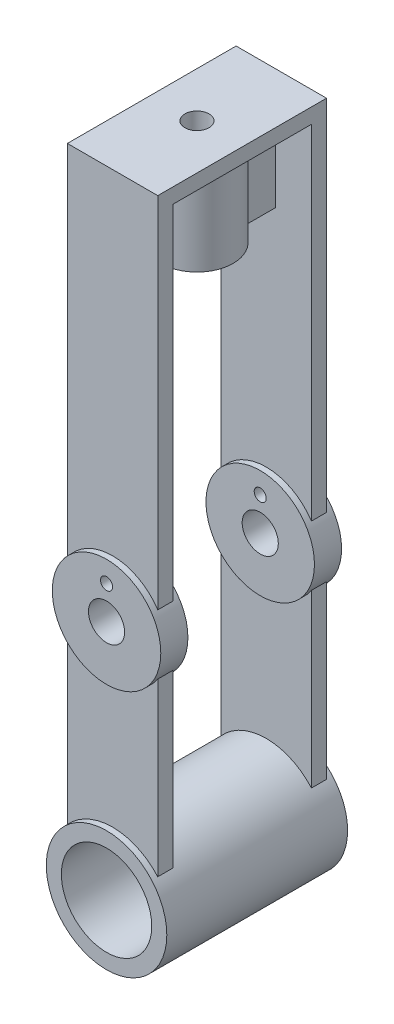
ISO-10303-21;
HEADER;
FILE_DESCRIPTION(('STEP AP214'),'2;1');
FILE_NAME('part.step','',(''),(''),'','','');
FILE_SCHEMA(('AUTOMOTIVE_DESIGN { 1 0 10303 214 1 1 1 1 }'));
ENDSEC;
DATA;
#1=APPLICATION_CONTEXT('core data for automotive mechanical design processes');
#2=APPLICATION_PROTOCOL_DEFINITION('international standard','automotive_design',2000,#1);
#3=PRODUCT_CONTEXT('',#1,'mechanical');
#4=PRODUCT('Part','Part','',(#3));
#5=PRODUCT_RELATED_PRODUCT_CATEGORY('part','',(#4));
#6=PRODUCT_DEFINITION_FORMATION('','',#4);
#7=PRODUCT_DEFINITION_CONTEXT('part definition',#1,'design');
#8=PRODUCT_DEFINITION('design','',#6,#7);
#9=PRODUCT_DEFINITION_SHAPE('','',#8);
#10=(LENGTH_UNIT() NAMED_UNIT(*) SI_UNIT(.MILLI.,.METRE.));
#11=(NAMED_UNIT(*) PLANE_ANGLE_UNIT() SI_UNIT($,.RADIAN.));
#12=(NAMED_UNIT(*) SI_UNIT($,.STERADIAN.) SOLID_ANGLE_UNIT());
#13=UNCERTAINTY_MEASURE_WITH_UNIT(LENGTH_MEASURE(1.E-05),#10,'distance_accuracy_value','');
#14=(GEOMETRIC_REPRESENTATION_CONTEXT(3) GLOBAL_UNCERTAINTY_ASSIGNED_CONTEXT((#13)) GLOBAL_UNIT_ASSIGNED_CONTEXT((#10,
#11,#12)) REPRESENTATION_CONTEXT('',''));
#15=CARTESIAN_POINT('',(0.,0.,0.));
#16=DIRECTION('',(0.,0.,1.));
#17=DIRECTION('',(1.,0.,0.));
#18=AXIS2_PLACEMENT_3D('',#15,#16,#17);
#19=CARTESIAN_POINT('',(125.5,78.5,-32.));
#20=DIRECTION('',(0.,-1.,0.));
#21=DIRECTION('',(0.,0.,1.));
#22=AXIS2_PLACEMENT_3D('',#19,#20,#21);
#23=PLANE('',#22);
#24=CARTESIAN_POINT('',(121.5,78.5,-28.));
#25=DIRECTION('',(0.,1.,0.));
#26=DIRECTION('',(-1.,0.,0.));
#27=AXIS2_PLACEMENT_3D('',#24,#25,#26);
#28=CIRCLE('',#27,4.);
#29=CARTESIAN_POINT('',(117.5,78.5,-28.));
#30=VERTEX_POINT('',#29);
#31=EDGE_CURVE('E326',#30,#30,#28,.F.);
#32=ORIENTED_EDGE('',*,*,#31,.F.);
#33=EDGE_LOOP('',(#32));
#34=FACE_BOUND('',#33,.T.);
#35=ADVANCED_FACE('F15',(#34),#23,.F.);
#36=CARTESIAN_POINT('',(121.5,-20.5,-58.));
#37=DIRECTION('',(0.,0.,1.));
#38=DIRECTION('',(1.,0.,0.));
#39=AXIS2_PLACEMENT_3D('',#36,#37,#38);
#40=CYLINDRICAL_SURFACE('',#39,5.99999999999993);
#41=CARTESIAN_POINT('',(121.5,-20.5,-49.));
#42=DIRECTION('',(0.,0.,1.));
#43=DIRECTION('',(1.,0.,0.));
#44=AXIS2_PLACEMENT_3D('',#41,#42,#43);
#45=CIRCLE('',#44,5.99999999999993);
#46=CARTESIAN_POINT('',(127.5,-20.5,-49.));
#47=VERTEX_POINT('',#46);
#48=EDGE_CURVE('E321',#47,#47,#45,.T.);
#49=ORIENTED_EDGE('',*,*,#48,.T.);
#50=EDGE_LOOP('',(#49));
#51=FACE_BOUND('',#50,.T.);
#52=CARTESIAN_POINT('',(121.5,-20.5,-58.));
#53=DIRECTION('',(0.,0.,1.));
#54=DIRECTION('',(1.,0.,0.));
#55=AXIS2_PLACEMENT_3D('',#52,#53,#54);
#56=CIRCLE('',#55,5.99999999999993);
#57=CARTESIAN_POINT('',(127.5,-20.5,-58.));
#58=VERTEX_POINT('',#57);
#59=EDGE_CURVE('E311',#58,#58,#56,.T.);
#60=ORIENTED_EDGE('',*,*,#59,.F.);
#61=EDGE_LOOP('',(#60));
#62=FACE_BOUND('',#61,.T.);
#63=ADVANCED_FACE('F913',(#51,#62),#40,.F.);
#64=CARTESIAN_POINT('',(121.5,-9.5,-58.));
#65=DIRECTION('',(0.,0.,1.));
#66=DIRECTION('',(1.,0.,0.));
#67=AXIS2_PLACEMENT_3D('',#64,#65,#66);
#68=CYLINDRICAL_SURFACE('',#67,1.99999999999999);
#69=CARTESIAN_POINT('',(121.5,-9.5,-49.));
#70=DIRECTION('',(0.,0.,1.));
#71=DIRECTION('',(1.,0.,0.));
#72=AXIS2_PLACEMENT_3D('',#69,#70,#71);
#73=CIRCLE('',#72,1.99999999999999);
#74=CARTESIAN_POINT('',(123.5,-9.5,-49.));
#75=VERTEX_POINT('',#74);
#76=EDGE_CURVE('E316',#75,#75,#73,.T.);
#77=ORIENTED_EDGE('',*,*,#76,.T.);
#78=EDGE_LOOP('',(#77));
#79=FACE_BOUND('',#78,.T.);
#80=CARTESIAN_POINT('',(121.5,-9.5,-58.));
#81=DIRECTION('',(0.,0.,1.));
#82=DIRECTION('',(1.,0.,0.));
#83=AXIS2_PLACEMENT_3D('',#80,#81,#82);
#84=CIRCLE('',#83,1.99999999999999);
#85=CARTESIAN_POINT('',(123.5,-9.5,-58.));
#86=VERTEX_POINT('',#85);
#87=EDGE_CURVE('E308',#86,#86,#84,.T.);
#88=ORIENTED_EDGE('',*,*,#87,.F.);
#89=EDGE_LOOP('',(#88));
#90=FACE_BOUND('',#89,.T.);
#91=ADVANCED_FACE('F906',(#79,#90),#68,.F.);
#92=CARTESIAN_POINT('',(121.5,103.5,-28.));
#93=DIRECTION('',(0.,-1.,0.));
#94=DIRECTION('',(0.,0.,-1.));
#95=AXIS2_PLACEMENT_3D('',#92,#93,#94);
#96=CYLINDRICAL_SURFACE('',#95,12.);
#97=DIRECTION('',(0.,-1.,0.));
#98=VECTOR('',#97,1.);
#99=CARTESIAN_POINT('',(124.5,88.5,-39.6189500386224));
#100=LINE('',#99,#98);
#101=CARTESIAN_POINT('',(124.5,103.5,-39.6189500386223));
#102=VERTEX_POINT('',#101);
#103=CARTESIAN_POINT('',(124.5,73.5,-39.6189500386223));
#104=VERTEX_POINT('',#103);
#105=EDGE_CURVE('E137',#102,#104,#100,.T.);
#106=ORIENTED_EDGE('',*,*,#105,.F.);
#107=CARTESIAN_POINT('',(121.5,103.5,-28.));
#108=DIRECTION('',(0.,-1.,0.));
#109=DIRECTION('',(0.,0.,-1.));
#110=AXIS2_PLACEMENT_3D('',#107,#108,#109);
#111=CIRCLE('',#110,12.);
#112=CARTESIAN_POINT('',(124.5,103.5,-16.3810499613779));
#113=VERTEX_POINT('',#112);
#114=EDGE_CURVE('E140',#102,#113,#111,.T.);
#115=ORIENTED_EDGE('',*,*,#114,.T.);
#116=DIRECTION('',(0.,1.,0.));
#117=VECTOR('',#116,1.);
#118=CARTESIAN_POINT('',(124.5,88.5,-16.381049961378));
#119=LINE('',#118,#117);
#120=CARTESIAN_POINT('',(124.5,73.5,-16.3810499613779));
#121=VERTEX_POINT('',#120);
#122=EDGE_CURVE('E144',#121,#113,#119,.T.);
#123=ORIENTED_EDGE('',*,*,#122,.F.);
#124=CARTESIAN_POINT('',(121.5,73.5,-28.));
#125=DIRECTION('',(0.,-1.,0.));
#126=DIRECTION('',(0.,0.,-1.));
#127=AXIS2_PLACEMENT_3D('',#124,#125,#126);
#128=CIRCLE('',#127,12.);
#129=EDGE_CURVE('E161',#104,#121,#128,.T.);
#130=ORIENTED_EDGE('',*,*,#129,.F.);
#131=EDGE_LOOP('',(#106,#115,#123,#130));
#132=FACE_BOUND('',#131,.T.);
#133=ADVANCED_FACE('F142',(#132),#96,.T.);
#134=CARTESIAN_POINT('',(124.5,73.5,-51.));
#135=DIRECTION('',(1.,0.,0.));
#136=DIRECTION('',(0.,1.,0.));
#137=AXIS2_PLACEMENT_3D('',#134,#135,#136);
#138=PLANE('',#137);
#139=DIRECTION('',(0.,0.,1.));
#140=VECTOR('',#139,1.);
#141=CARTESIAN_POINT('',(124.5,103.5,-28.));
#142=LINE('',#141,#140);
#143=CARTESIAN_POINT('',(124.5,103.5,-51.));
#144=VERTEX_POINT('',#143);
#145=EDGE_CURVE('E148',#144,#102,#142,.T.);
#146=ORIENTED_EDGE('',*,*,#145,.T.);
#147=ORIENTED_EDGE('',*,*,#105,.T.);
#148=DIRECTION('',(0.,0.,1.));
#149=VECTOR('',#148,1.);
#150=CARTESIAN_POINT('',(124.5,73.5,-28.));
#151=LINE('',#150,#149);
#152=CARTESIAN_POINT('',(124.5,73.5000000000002,-51.));
#153=VERTEX_POINT('',#152);
#154=EDGE_CURVE('E399',#153,#104,#151,.T.);
#155=ORIENTED_EDGE('',*,*,#154,.F.);
#156=DIRECTION('',(0.,1.,0.));
#157=VECTOR('',#156,1.);
#158=CARTESIAN_POINT('',(124.5,8.11437827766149,-51.));
#159=LINE('',#158,#157);
#160=EDGE_CURVE('E347',#153,#144,#159,.T.);
#161=ORIENTED_EDGE('',*,*,#160,.T.);
#162=EDGE_LOOP('',(#146,#147,#155,#161));
#163=FACE_BOUND('',#162,.T.);
#164=ADVANCED_FACE('F525',(#163),#138,.T.);
#165=CARTESIAN_POINT('',(121.5,103.5,-28.));
#166=DIRECTION('',(0.,-1.,0.));
#167=DIRECTION('',(0.,0.,-1.));
#168=AXIS2_PLACEMENT_3D('',#165,#166,#167);
#169=CYLINDRICAL_SURFACE('',#168,12.);
#170=CARTESIAN_POINT('',(121.5,73.5,-28.));
#171=DIRECTION('',(0.,-1.,0.));
#172=DIRECTION('',(0.,0.,-1.));
#173=AXIS2_PLACEMENT_3D('',#170,#171,#172);
#174=CIRCLE('',#173,12.);
#175=CARTESIAN_POINT('',(118.5,73.5,-16.3810499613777));
#176=VERTEX_POINT('',#175);
#177=CARTESIAN_POINT('',(118.5,73.5,-39.6189500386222));
#178=VERTEX_POINT('',#177);
#179=EDGE_CURVE('E303',#176,#178,#174,.T.);
#180=ORIENTED_EDGE('',*,*,#179,.F.);
#181=DIRECTION('',(0.,-1.,0.));
#182=VECTOR('',#181,1.);
#183=CARTESIAN_POINT('',(118.5,88.5,-16.3810499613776));
#184=LINE('',#183,#182);
#185=CARTESIAN_POINT('',(118.5,103.5,-16.3810499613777));
#186=VERTEX_POINT('',#185);
#187=EDGE_CURVE('E342',#186,#176,#184,.T.);
#188=ORIENTED_EDGE('',*,*,#187,.F.);
#189=CARTESIAN_POINT('',(121.5,103.5,-28.));
#190=DIRECTION('',(0.,-1.,0.));
#191=DIRECTION('',(0.,0.,-1.));
#192=AXIS2_PLACEMENT_3D('',#189,#190,#191);
#193=CIRCLE('',#192,12.);
#194=CARTESIAN_POINT('',(118.5,103.5,-39.6189500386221));
#195=VERTEX_POINT('',#194);
#196=EDGE_CURVE('E299',#186,#195,#193,.T.);
#197=ORIENTED_EDGE('',*,*,#196,.T.);
#198=DIRECTION('',(0.,1.,0.));
#199=VECTOR('',#198,1.);
#200=CARTESIAN_POINT('',(118.5,88.5,-39.618950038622));
#201=LINE('',#200,#199);
#202=EDGE_CURVE('E329',#178,#195,#201,.T.);
#203=ORIENTED_EDGE('',*,*,#202,.F.);
#204=EDGE_LOOP('',(#180,#188,#197,#203));
#205=FACE_BOUND('',#204,.T.);
#206=ADVANCED_FACE('F573',(#205),#169,.T.);
#207=CARTESIAN_POINT('',(118.5,73.5,-39.618950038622));
#208=DIRECTION('',(-1.,0.,0.));
#209=DIRECTION('',(0.,1.,0.));
#210=AXIS2_PLACEMENT_3D('',#207,#208,#209);
#211=PLANE('',#210);
#212=DIRECTION('',(0.,0.,-1.));
#213=VECTOR('',#212,1.);
#214=CARTESIAN_POINT('',(118.5,103.5,-28.));
#215=LINE('',#214,#213);
#216=CARTESIAN_POINT('',(118.5,103.5,-51.));
#217=VERTEX_POINT('',#216);
#218=EDGE_CURVE('E301',#195,#217,#215,.T.);
#219=ORIENTED_EDGE('',*,*,#218,.T.);
#220=DIRECTION('',(0.,-1.,0.));
#221=VECTOR('',#220,1.);
#222=CARTESIAN_POINT('',(118.5,8.11437827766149,-51.));
#223=LINE('',#222,#221);
#224=CARTESIAN_POINT('',(118.5,73.5000000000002,-51.));
#225=VERTEX_POINT('',#224);
#226=EDGE_CURVE('E345',#217,#225,#223,.T.);
#227=ORIENTED_EDGE('',*,*,#226,.T.);
#228=DIRECTION('',(0.,0.,-1.));
#229=VECTOR('',#228,1.);
#230=CARTESIAN_POINT('',(118.5,73.5,-28.));
#231=LINE('',#230,#229);
#232=EDGE_CURVE('E306',#178,#225,#231,.T.);
#233=ORIENTED_EDGE('',*,*,#232,.F.);
#234=ORIENTED_EDGE('',*,*,#202,.T.);
#235=EDGE_LOOP('',(#219,#227,#233,#234));
#236=FACE_BOUND('',#235,.T.);
#237=ADVANCED_FACE('F881',(#236),#211,.T.);
#238=CARTESIAN_POINT('',(118.5,95.5,-55.5));
#239=DIRECTION('',(1.,0.,0.));
#240=DIRECTION('',(0.,0.,1.));
#241=AXIS2_PLACEMENT_3D('',#238,#239,#240);
#242=PLANE('',#241);
#243=CARTESIAN_POINT('',(118.5,93.5,-53.5));
#244=DIRECTION('',(-1.,0.,0.));
#245=DIRECTION('',(0.,-1.,0.));
#246=AXIS2_PLACEMENT_3D('',#243,#244,#245);
#247=CIRCLE('',#246,2.);
#248=CARTESIAN_POINT('',(118.5,91.5,-53.5));
#249=VERTEX_POINT('',#248);
#250=EDGE_CURVE('E291',#249,#249,#247,.F.);
#251=ORIENTED_EDGE('',*,*,#250,.F.);
#252=EDGE_LOOP('',(#251));
#253=FACE_BOUND('',#252,.T.);
#254=ADVANCED_FACE('F873',(#253),#242,.F.);
#255=CARTESIAN_POINT('',(118.5,95.5,-4.5));
#256=DIRECTION('',(1.,0.,0.));
#257=DIRECTION('',(0.,0.,1.));
#258=AXIS2_PLACEMENT_3D('',#255,#256,#257);
#259=PLANE('',#258);
#260=CARTESIAN_POINT('',(118.5,93.5,-2.5));
#261=DIRECTION('',(-1.,0.,0.));
#262=DIRECTION('',(0.,-1.,0.));
#263=AXIS2_PLACEMENT_3D('',#260,#261,#262);
#264=CIRCLE('',#263,2.);
#265=CARTESIAN_POINT('',(118.5,91.5,-2.5));
#266=VERTEX_POINT('',#265);
#267=EDGE_CURVE('E288',#266,#266,#264,.F.);
#268=ORIENTED_EDGE('',*,*,#267,.F.);
#269=EDGE_LOOP('',(#268));
#270=FACE_BOUND('',#269,.T.);
#271=ADVANCED_FACE('F867',(#270),#259,.F.);
#272=CARTESIAN_POINT('',(121.5,78.5,-28.));
#273=DIRECTION('',(0.,1.,0.));
#274=DIRECTION('',(-1.,0.,0.));
#275=AXIS2_PLACEMENT_3D('',#272,#273,#274);
#276=CYLINDRICAL_SURFACE('',#275,4.);
#277=ORIENTED_EDGE('',*,*,#31,.T.);
#278=EDGE_LOOP('',(#277));
#279=FACE_BOUND('',#278,.T.);
#280=CARTESIAN_POINT('',(121.5,108.5,-28.));
#281=DIRECTION('',(0.,1.,0.));
#282=DIRECTION('',(-1.,0.,0.));
#283=AXIS2_PLACEMENT_3D('',#280,#281,#282);
#284=CIRCLE('',#283,4.);
#285=CARTESIAN_POINT('',(117.5,108.5,-28.));
#286=VERTEX_POINT('',#285);
#287=EDGE_CURVE('E280',#286,#286,#284,.F.);
#288=ORIENTED_EDGE('',*,*,#287,.F.);
#289=EDGE_LOOP('',(#288));
#290=FACE_BOUND('',#289,.T.);
#291=ADVANCED_FACE('F859',(#279,#290),#276,.F.);
#292=CARTESIAN_POINT('',(139.5,-38.5,-49.));
#293=DIRECTION('',(0.,0.,-1.));
#294=DIRECTION('',(-1.,0.,0.));
#295=AXIS2_PLACEMENT_3D('',#292,#293,#294);
#296=PLANE('',#295);
#297=ORIENTED_EDGE('',*,*,#76,.F.);
#298=EDGE_LOOP('',(#297));
#299=FACE_BOUND('',#298,.T.);
#300=ORIENTED_EDGE('',*,*,#48,.F.);
#301=EDGE_LOOP('',(#300));
#302=FACE_BOUND('',#301,.T.);
#303=CARTESIAN_POINT('',(121.5,-20.5,-49.));
#304=DIRECTION('',(0.,0.,1.));
#305=DIRECTION('',(1.,0.,0.));
#306=AXIS2_PLACEMENT_3D('',#303,#304,#305);
#307=CIRCLE('',#306,18.);
#308=CARTESIAN_POINT('',(139.5,-20.5,-49.));
#309=VERTEX_POINT('',#308);
#310=EDGE_CURVE('E275',#309,#309,#307,.T.);
#311=ORIENTED_EDGE('',*,*,#310,.T.);
#312=EDGE_LOOP('',(#311));
#313=FACE_BOUND('',#312,.T.);
#314=ADVANCED_FACE('F851',(#299,#302,#313),#296,.F.);
#315=CARTESIAN_POINT('',(103.5,-2.5,-58.));
#316=DIRECTION('',(0.,0.,-1.));
#317=DIRECTION('',(1.,0.,0.));
#318=AXIS2_PLACEMENT_3D('',#315,#316,#317);
#319=PLANE('',#318);
#320=ORIENTED_EDGE('',*,*,#87,.T.);
#321=EDGE_LOOP('',(#320));
#322=FACE_BOUND('',#321,.T.);
#323=ORIENTED_EDGE('',*,*,#59,.T.);
#324=EDGE_LOOP('',(#323));
#325=FACE_BOUND('',#324,.T.);
#326=CARTESIAN_POINT('',(121.5,-20.5,-58.));
#327=DIRECTION('',(0.,0.,1.));
#328=DIRECTION('',(1.,0.,0.));
#329=AXIS2_PLACEMENT_3D('',#326,#327,#328);
#330=CIRCLE('',#329,18.);
#331=CARTESIAN_POINT('',(139.5,-20.5,-58.));
#332=VERTEX_POINT('',#331);
#333=EDGE_CURVE('E272',#332,#332,#330,.F.);
#334=ORIENTED_EDGE('',*,*,#333,.T.);
#335=EDGE_LOOP('',(#334));
#336=FACE_BOUND('',#335,.T.);
#337=ADVANCED_FACE('F844',(#322,#325,#336),#319,.T.);
#338=CARTESIAN_POINT('',(121.5,-20.5,-7.));
#339=DIRECTION('',(0.,0.,1.));
#340=DIRECTION('',(1.,0.,0.));
#341=AXIS2_PLACEMENT_3D('',#338,#339,#340);
#342=CYLINDRICAL_SURFACE('',#341,5.99999999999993);
#343=CARTESIAN_POINT('',(121.5,-20.5,-7.));
#344=DIRECTION('',(0.,0.,1.));
#345=DIRECTION('',(1.,0.,0.));
#346=AXIS2_PLACEMENT_3D('',#343,#344,#345);
#347=CIRCLE('',#346,5.99999999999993);
#348=CARTESIAN_POINT('',(127.5,-20.5,-7.));
#349=VERTEX_POINT('',#348);
#350=EDGE_CURVE('E261',#349,#349,#347,.F.);
#351=ORIENTED_EDGE('',*,*,#350,.T.);
#352=EDGE_LOOP('',(#351));
#353=FACE_BOUND('',#352,.T.);
#354=CARTESIAN_POINT('',(121.5,-20.5,2.));
#355=DIRECTION('',(0.,0.,1.));
#356=DIRECTION('',(1.,0.,0.));
#357=AXIS2_PLACEMENT_3D('',#354,#355,#356);
#358=CIRCLE('',#357,5.99999999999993);
#359=CARTESIAN_POINT('',(127.5,-20.5,2.));
#360=VERTEX_POINT('',#359);
#361=EDGE_CURVE('E251',#360,#360,#358,.F.);
#362=ORIENTED_EDGE('',*,*,#361,.F.);
#363=EDGE_LOOP('',(#362));
#364=FACE_BOUND('',#363,.T.);
#365=ADVANCED_FACE('F835',(#353,#364),#342,.F.);
#366=CARTESIAN_POINT('',(121.5,-9.5,-7.));
#367=DIRECTION('',(0.,0.,1.));
#368=DIRECTION('',(1.,0.,0.));
#369=AXIS2_PLACEMENT_3D('',#366,#367,#368);
#370=CYLINDRICAL_SURFACE('',#369,1.99999999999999);
#371=CARTESIAN_POINT('',(121.5,-9.5,-7.));
#372=DIRECTION('',(0.,0.,1.));
#373=DIRECTION('',(1.,0.,0.));
#374=AXIS2_PLACEMENT_3D('',#371,#372,#373);
#375=CIRCLE('',#374,1.99999999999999);
#376=CARTESIAN_POINT('',(123.5,-9.5,-7.));
#377=VERTEX_POINT('',#376);
#378=EDGE_CURVE('E256',#377,#377,#375,.F.);
#379=ORIENTED_EDGE('',*,*,#378,.T.);
#380=EDGE_LOOP('',(#379));
#381=FACE_BOUND('',#380,.T.);
#382=CARTESIAN_POINT('',(121.5,-9.5,2.));
#383=DIRECTION('',(0.,0.,1.));
#384=DIRECTION('',(1.,0.,0.));
#385=AXIS2_PLACEMENT_3D('',#382,#383,#384);
#386=CIRCLE('',#385,1.99999999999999);
#387=CARTESIAN_POINT('',(123.5,-9.5,2.));
#388=VERTEX_POINT('',#387);
#389=EDGE_CURVE('E247',#388,#388,#386,.F.);
#390=ORIENTED_EDGE('',*,*,#389,.F.);
#391=EDGE_LOOP('',(#390));
#392=FACE_BOUND('',#391,.T.);
#393=ADVANCED_FACE('F827',(#381,#392),#370,.F.);
#394=CARTESIAN_POINT('',(169.500000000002,103.5,-51.));
#395=DIRECTION('',(0.,1.,0.));
#396=DIRECTION('',(-1.,0.,0.));
#397=AXIS2_PLACEMENT_3D('',#394,#395,#396);
#398=PLANE('',#397);
#399=DIRECTION('',(-1.,0.,0.));
#400=VECTOR('',#399,1.);
#401=CARTESIAN_POINT('',(41.1143782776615,103.5,-5.));
#402=LINE('',#401,#400);
#403=CARTESIAN_POINT('',(136.5,103.5,-5.00000000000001));
#404=VERTEX_POINT('',#403);
#405=CARTESIAN_POINT('',(124.5,103.5,-5.));
#406=VERTEX_POINT('',#405);
#407=EDGE_CURVE('E157',#404,#406,#402,.T.);
#408=ORIENTED_EDGE('',*,*,#407,.T.);
#409=DIRECTION('',(0.,0.,1.));
#410=VECTOR('',#409,1.);
#411=CARTESIAN_POINT('',(124.5,103.5,-1.381049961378));
#412=LINE('',#411,#410);
#413=EDGE_CURVE('E152',#113,#406,#412,.T.);
#414=ORIENTED_EDGE('',*,*,#413,.F.);
#415=ORIENTED_EDGE('',*,*,#114,.F.);
#416=ORIENTED_EDGE('',*,*,#145,.F.);
#417=DIRECTION('',(1.,0.,0.));
#418=VECTOR('',#417,1.);
#419=CARTESIAN_POINT('',(41.1143782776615,103.5,-51.));
#420=LINE('',#419,#418);
#421=CARTESIAN_POINT('',(136.5,103.5,-51.0000000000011));
#422=VERTEX_POINT('',#421);
#423=EDGE_CURVE('E350',#144,#422,#420,.T.);
#424=ORIENTED_EDGE('',*,*,#423,.T.);
#425=DIRECTION('',(0.,0.,-1.));
#426=VECTOR('',#425,1.);
#427=CARTESIAN_POINT('',(136.5,103.5,-97.88562172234));
#428=LINE('',#427,#426);
#429=EDGE_CURVE('E250',#404,#422,#428,.T.);
#430=ORIENTED_EDGE('',*,*,#429,.F.);
#431=EDGE_LOOP('',(#408,#414,#415,#416,#424,#430));
#432=FACE_BOUND('',#431,.T.);
#433=ADVANCED_FACE('F153',(#432),#398,.F.);
#434=CARTESIAN_POINT('',(124.5,73.5,-16.381049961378));
#435=DIRECTION('',(1.,0.,0.));
#436=DIRECTION('',(0.,1.,0.));
#437=AXIS2_PLACEMENT_3D('',#434,#435,#436);
#438=PLANE('',#437);
#439=ORIENTED_EDGE('',*,*,#413,.T.);
#440=DIRECTION('',(0.,-1.,0.));
#441=VECTOR('',#440,1.);
#442=CARTESIAN_POINT('',(124.5,8.1143782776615,-5.));
#443=LINE('',#442,#441);
#444=CARTESIAN_POINT('',(124.5,73.5000000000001,-5.));
#445=VERTEX_POINT('',#444);
#446=EDGE_CURVE('E387',#406,#445,#443,.T.);
#447=ORIENTED_EDGE('',*,*,#446,.T.);
#448=DIRECTION('',(0.,0.,1.));
#449=VECTOR('',#448,1.);
#450=CARTESIAN_POINT('',(124.5,73.5,-28.));
#451=LINE('',#450,#449);
#452=EDGE_CURVE('E165',#121,#445,#451,.T.);
#453=ORIENTED_EDGE('',*,*,#452,.F.);
#454=ORIENTED_EDGE('',*,*,#122,.T.);
#455=EDGE_LOOP('',(#439,#447,#453,#454));
#456=FACE_BOUND('',#455,.T.);
#457=ADVANCED_FACE('F163',(#456),#438,.T.);
#458=CARTESIAN_POINT('',(109.5,73.5,-51.));
#459=DIRECTION('',(0.,-1.,0.));
#460=DIRECTION('',(1.,0.,0.));
#461=AXIS2_PLACEMENT_3D('',#458,#459,#460);
#462=PLANE('',#461);
#463=DIRECTION('',(1.,0.,0.));
#464=VECTOR('',#463,1.);
#465=CARTESIAN_POINT('',(41.1143782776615,73.5000000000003,-51.));
#466=LINE('',#465,#464);
#467=EDGE_CURVE('E351',#225,#153,#466,.T.);
#468=ORIENTED_EDGE('',*,*,#467,.T.);
#469=ORIENTED_EDGE('',*,*,#154,.T.);
#470=ORIENTED_EDGE('',*,*,#129,.T.);
#471=ORIENTED_EDGE('',*,*,#452,.T.);
#472=DIRECTION('',(-1.,0.,0.));
#473=VECTOR('',#472,1.);
#474=CARTESIAN_POINT('',(41.1143782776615,73.5000000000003,-5.));
#475=LINE('',#474,#473);
#476=CARTESIAN_POINT('',(118.5,73.5000000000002,-5.));
#477=VERTEX_POINT('',#476);
#478=EDGE_CURVE('E389',#445,#477,#475,.T.);
#479=ORIENTED_EDGE('',*,*,#478,.T.);
#480=DIRECTION('',(0.,0.,1.));
#481=VECTOR('',#480,1.);
#482=CARTESIAN_POINT('',(118.5,73.5,-20.));
#483=LINE('',#482,#481);
#484=EDGE_CURVE('E346',#176,#477,#483,.T.);
#485=ORIENTED_EDGE('',*,*,#484,.F.);
#486=ORIENTED_EDGE('',*,*,#179,.T.);
#487=ORIENTED_EDGE('',*,*,#232,.T.);
#488=EDGE_LOOP('',(#468,#469,#470,#471,#479,#485,#486,#487));
#489=FACE_BOUND('',#488,.T.);
#490=ADVANCED_FACE('F558',(#489),#462,.T.);
#491=CARTESIAN_POINT('',(118.5,73.5,-5.));
#492=DIRECTION('',(-1.,0.,0.));
#493=DIRECTION('',(0.,1.,0.));
#494=AXIS2_PLACEMENT_3D('',#491,#492,#493);
#495=PLANE('',#494);
#496=DIRECTION('',(0.,0.,-1.));
#497=VECTOR('',#496,1.);
#498=CARTESIAN_POINT('',(118.5,103.5,-28.));
#499=LINE('',#498,#497);
#500=CARTESIAN_POINT('',(118.5,103.5,-5.));
#501=VERTEX_POINT('',#500);
#502=EDGE_CURVE('E302',#501,#186,#499,.T.);
#503=ORIENTED_EDGE('',*,*,#502,.T.);
#504=ORIENTED_EDGE('',*,*,#187,.T.);
#505=ORIENTED_EDGE('',*,*,#484,.T.);
#506=DIRECTION('',(0.,1.,0.));
#507=VECTOR('',#506,1.);
#508=CARTESIAN_POINT('',(118.5,8.11437827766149,-5.));
#509=LINE('',#508,#507);
#510=EDGE_CURVE('E394',#477,#501,#509,.T.);
#511=ORIENTED_EDGE('',*,*,#510,.T.);
#512=EDGE_LOOP('',(#503,#504,#505,#511));
#513=FACE_BOUND('',#512,.T.);
#514=ADVANCED_FACE('F566',(#513),#495,.T.);
#515=CARTESIAN_POINT('',(136.5,-87.271243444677,-56.));
#516=DIRECTION('',(0.,0.,-1.));
#517=DIRECTION('',(-1.,0.,0.));
#518=AXIS2_PLACEMENT_3D('',#515,#516,#517);
#519=PLANE('',#518);
#520=DIRECTION('',(0.,1.,0.));
#521=VECTOR('',#520,1.);
#522=CARTESIAN_POINT('',(136.5,10.6143782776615,-56.0000000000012));
#523=LINE('',#522,#521);
#524=CARTESIAN_POINT('',(136.5,-10.5501256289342,-56.0000000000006));
#525=VERTEX_POINT('',#524);
#526=CARTESIAN_POINT('',(136.5,108.5,-56.0000000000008));
#527=VERTEX_POINT('',#526);
#528=EDGE_CURVE('E377',#525,#527,#523,.T.);
#529=ORIENTED_EDGE('',*,*,#528,.F.);
#530=CARTESIAN_POINT('',(121.5,-20.5,-56.));
#531=DIRECTION('',(0.,0.,1.));
#532=DIRECTION('',(1.,0.,0.));
#533=AXIS2_PLACEMENT_3D('',#530,#531,#532);
#534=CIRCLE('',#533,18.);
#535=CARTESIAN_POINT('',(106.5,-10.5501256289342,-56.0000000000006));
#536=VERTEX_POINT('',#535);
#537=EDGE_CURVE('E270',#525,#536,#534,.T.);
#538=ORIENTED_EDGE('',*,*,#537,.T.);
#539=DIRECTION('',(0.,-1.,0.));
#540=VECTOR('',#539,1.);
#541=CARTESIAN_POINT('',(106.5,10.6143782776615,-56.0000000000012));
#542=LINE('',#541,#540);
#543=CARTESIAN_POINT('',(106.5,108.5,-56.0000000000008));
#544=VERTEX_POINT('',#543);
#545=EDGE_CURVE('E418',#544,#536,#542,.T.);
#546=ORIENTED_EDGE('',*,*,#545,.F.);
#547=DIRECTION('',(-1.,0.,0.));
#548=VECTOR('',#547,1.);
#549=CARTESIAN_POINT('',(108.5,108.5,-56.));
#550=LINE('',#549,#548);
#551=EDGE_CURVE('E285',#527,#544,#550,.T.);
#552=ORIENTED_EDGE('',*,*,#551,.F.);
#553=EDGE_LOOP('',(#529,#538,#546,#552));
#554=FACE_BOUND('',#553,.T.);
#555=ADVANCED_FACE('F585',(#554),#519,.T.);
#556=CARTESIAN_POINT('',(136.5,-87.271243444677,-51.));
#557=DIRECTION('',(0.,0.,-1.));
#558=DIRECTION('',(-1.,0.,0.));
#559=AXIS2_PLACEMENT_3D('',#556,#557,#558);
#560=PLANE('',#559);
#561=ORIENTED_EDGE('',*,*,#423,.F.);
#562=ORIENTED_EDGE('',*,*,#160,.F.);
#563=ORIENTED_EDGE('',*,*,#467,.F.);
#564=ORIENTED_EDGE('',*,*,#226,.F.);
#565=DIRECTION('',(-1.,0.,0.));
#566=VECTOR('',#565,1.);
#567=CARTESIAN_POINT('',(113.5,103.5,-51.));
#568=LINE('',#567,#566);
#569=CARTESIAN_POINT('',(106.5,103.5,-51.0000000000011));
#570=VERTEX_POINT('',#569);
#571=EDGE_CURVE('E296',#217,#570,#568,.T.);
#572=ORIENTED_EDGE('',*,*,#571,.T.);
#573=DIRECTION('',(0.,1.,0.));
#574=VECTOR('',#573,1.);
#575=CARTESIAN_POINT('',(106.5,10.6143782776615,-51.0000000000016));
#576=LINE('',#575,#574);
#577=CARTESIAN_POINT('',(106.5,-10.5501256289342,-51.0000000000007));
#578=VERTEX_POINT('',#577);
#579=EDGE_CURVE('E425',#578,#570,#576,.T.);
#580=ORIENTED_EDGE('',*,*,#579,.F.);
#581=CARTESIAN_POINT('',(121.5,-20.5,-50.9999999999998));
#582=DIRECTION('',(0.,0.,1.));
#583=DIRECTION('',(1.,0.,0.));
#584=AXIS2_PLACEMENT_3D('',#581,#582,#583);
#585=CIRCLE('',#584,18.);
#586=CARTESIAN_POINT('',(136.5,-10.5501256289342,-51.0000000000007));
#587=VERTEX_POINT('',#586);
#588=EDGE_CURVE('E266',#578,#587,#585,.F.);
#589=ORIENTED_EDGE('',*,*,#588,.T.);
#590=DIRECTION('',(0.,-1.,0.));
#591=VECTOR('',#590,1.);
#592=CARTESIAN_POINT('',(136.5,10.6143782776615,-51.0000000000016));
#593=LINE('',#592,#591);
#594=EDGE_CURVE('E371',#422,#587,#593,.T.);
#595=ORIENTED_EDGE('',*,*,#594,.F.);
#596=EDGE_LOOP('',(#561,#562,#563,#564,#572,#580,#589,#595));
#597=FACE_BOUND('',#596,.T.);
#598=ADVANCED_FACE('F530',(#597),#560,.F.);
#599=CARTESIAN_POINT('',(136.5,103.5,-51.));
#600=DIRECTION('',(0.,1.,0.));
#601=DIRECTION('',(-1.,0.,0.));
#602=AXIS2_PLACEMENT_3D('',#599,#600,#601);
#603=PLANE('',#602);
#604=DIRECTION('',(0.,0.,1.));
#605=VECTOR('',#604,1.);
#606=CARTESIAN_POINT('',(106.5,103.5,-97.88562172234));
#607=LINE('',#606,#605);
#608=CARTESIAN_POINT('',(106.5,103.5,-5.00000000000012));
#609=VERTEX_POINT('',#608);
#610=EDGE_CURVE('E430',#570,#609,#607,.T.);
#611=ORIENTED_EDGE('',*,*,#610,.F.);
#612=ORIENTED_EDGE('',*,*,#571,.F.);
#613=ORIENTED_EDGE('',*,*,#218,.F.);
#614=ORIENTED_EDGE('',*,*,#196,.F.);
#615=ORIENTED_EDGE('',*,*,#502,.F.);
#616=DIRECTION('',(-1.,0.,0.));
#617=VECTOR('',#616,1.);
#618=CARTESIAN_POINT('',(41.1143782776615,103.5,-5.));
#619=LINE('',#618,#617);
#620=EDGE_CURVE('E404',#501,#609,#619,.T.);
#621=ORIENTED_EDGE('',*,*,#620,.T.);
#622=EDGE_LOOP('',(#611,#612,#613,#614,#615,#621));
#623=FACE_BOUND('',#622,.T.);
#624=ADVANCED_FACE('F569',(#623),#603,.F.);
#625=CARTESIAN_POINT('',(118.5,93.5,-53.5));
#626=DIRECTION('',(-1.,0.,0.));
#627=DIRECTION('',(0.,-1.,0.));
#628=AXIS2_PLACEMENT_3D('',#625,#626,#627);
#629=CYLINDRICAL_SURFACE('',#628,2.);
#630=ORIENTED_EDGE('',*,*,#250,.T.);
#631=EDGE_LOOP('',(#630));
#632=FACE_BOUND('',#631,.T.);
#633=CARTESIAN_POINT('',(106.5,93.5,-53.5));
#634=DIRECTION('',(-1.,0.,0.));
#635=DIRECTION('',(0.,-1.,0.));
#636=AXIS2_PLACEMENT_3D('',#633,#634,#635);
#637=CIRCLE('',#636,2.);
#638=CARTESIAN_POINT('',(106.5,91.5,-53.5));
#639=VERTEX_POINT('',#638);
#640=EDGE_CURVE('E239',#639,#639,#637,.F.);
#641=ORIENTED_EDGE('',*,*,#640,.F.);
#642=EDGE_LOOP('',(#641));
#643=FACE_BOUND('',#642,.T.);
#644=ADVANCED_FACE('F779',(#632,#643),#629,.F.);
#645=CARTESIAN_POINT('',(118.5,93.5,-2.5));
#646=DIRECTION('',(-1.,0.,0.));
#647=DIRECTION('',(0.,-1.,0.));
#648=AXIS2_PLACEMENT_3D('',#645,#646,#647);
#649=CYLINDRICAL_SURFACE('',#648,2.);
#650=ORIENTED_EDGE('',*,*,#267,.T.);
#651=EDGE_LOOP('',(#650));
#652=FACE_BOUND('',#651,.T.);
#653=CARTESIAN_POINT('',(106.5,93.5,-2.5));
#654=DIRECTION('',(-1.,0.,0.));
#655=DIRECTION('',(0.,-1.,0.));
#656=AXIS2_PLACEMENT_3D('',#653,#654,#655);
#657=CIRCLE('',#656,2.);
#658=CARTESIAN_POINT('',(106.5,91.5,-2.5));
#659=VERTEX_POINT('',#658);
#660=EDGE_CURVE('E235',#659,#659,#657,.F.);
#661=ORIENTED_EDGE('',*,*,#660,.F.);
#662=EDGE_LOOP('',(#661));
#663=FACE_BOUND('',#662,.T.);
#664=ADVANCED_FACE('F769',(#652,#663),#649,.F.);
#665=CARTESIAN_POINT('',(136.5,108.5,0.));
#666=DIRECTION('',(0.,1.,0.));
#667=DIRECTION('',(0.,0.,-1.));
#668=AXIS2_PLACEMENT_3D('',#665,#666,#667);
#669=PLANE('',#668);
#670=ORIENTED_EDGE('',*,*,#287,.T.);
#671=EDGE_LOOP('',(#670));
#672=FACE_BOUND('',#671,.T.);
#673=ORIENTED_EDGE('',*,*,#551,.T.);
#674=DIRECTION('',(0.,0.,-1.));
#675=VECTOR('',#674,1.);
#676=CARTESIAN_POINT('',(106.5,108.5,-97.88562172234));
#677=LINE('',#676,#675);
#678=CARTESIAN_POINT('',(106.5,108.5,0.));
#679=VERTEX_POINT('',#678);
#680=EDGE_CURVE('E422',#679,#544,#677,.T.);
#681=ORIENTED_EDGE('',*,*,#680,.F.);
#682=DIRECTION('',(-1.,0.,0.));
#683=VECTOR('',#682,1.);
#684=CARTESIAN_POINT('',(204.38562172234,108.5,0.));
#685=LINE('',#684,#683);
#686=CARTESIAN_POINT('',(136.500000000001,108.5,0.));
#687=VERTEX_POINT('',#686);
#688=EDGE_CURVE('E450',#687,#679,#685,.T.);
#689=ORIENTED_EDGE('',*,*,#688,.F.);
#690=DIRECTION('',(0.,0.,1.));
#691=VECTOR('',#690,1.);
#692=CARTESIAN_POINT('',(136.5,108.5,-97.88562172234));
#693=LINE('',#692,#691);
#694=EDGE_CURVE('E382',#527,#687,#693,.T.);
#695=ORIENTED_EDGE('',*,*,#694,.F.);
#696=EDGE_LOOP('',(#673,#681,#689,#695));
#697=FACE_BOUND('',#696,.T.);
#698=ADVANCED_FACE('F588',(#672,#697),#669,.T.);
#699=CARTESIAN_POINT('',(121.5,-100.5,-58.));
#700=DIRECTION('',(0.,0.,1.));
#701=DIRECTION('',(1.,0.,0.));
#702=AXIS2_PLACEMENT_3D('',#699,#700,#701);
#703=CYLINDRICAL_SURFACE('',#702,15.);
#704=CARTESIAN_POINT('',(121.5,-100.5,-58.));
#705=DIRECTION('',(0.,0.,1.));
#706=DIRECTION('',(1.,0.,0.));
#707=AXIS2_PLACEMENT_3D('',#704,#705,#706);
#708=CIRCLE('',#707,15.);
#709=CARTESIAN_POINT('',(136.5,-100.5,-58.));
#710=VERTEX_POINT('',#709);
#711=EDGE_CURVE('E227',#710,#710,#708,.T.);
#712=ORIENTED_EDGE('',*,*,#711,.F.);
#713=EDGE_LOOP('',(#712));
#714=FACE_BOUND('',#713,.T.);
#715=CARTESIAN_POINT('',(121.5,-100.5,2.));
#716=DIRECTION('',(0.,0.,1.));
#717=DIRECTION('',(1.,0.,0.));
#718=AXIS2_PLACEMENT_3D('',#715,#716,#717);
#719=CIRCLE('',#718,15.);
#720=CARTESIAN_POINT('',(136.5,-100.5,2.));
#721=VERTEX_POINT('',#720);
#722=EDGE_CURVE('E224',#721,#721,#719,.F.);
#723=ORIENTED_EDGE('',*,*,#722,.F.);
#724=EDGE_LOOP('',(#723));
#725=FACE_BOUND('',#724,.T.);
#726=ADVANCED_FACE('F752',(#714,#725),#703,.F.);
#727=CARTESIAN_POINT('',(121.5,-20.5,-58.));
#728=DIRECTION('',(0.,0.,1.));
#729=DIRECTION('',(1.,0.,0.));
#730=AXIS2_PLACEMENT_3D('',#727,#728,#729);
#731=CYLINDRICAL_SURFACE('',#730,18.);
#732=ORIENTED_EDGE('',*,*,#333,.F.);
#733=EDGE_LOOP('',(#732));
#734=FACE_BOUND('',#733,.T.);
#735=ORIENTED_EDGE('',*,*,#588,.F.);
#736=DIRECTION('',(0.,0.,1.));
#737=VECTOR('',#736,1.);
#738=CARTESIAN_POINT('',(106.5,-10.5501256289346,-97.88562172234));
#739=LINE('',#738,#737);
#740=EDGE_CURVE('E421',#536,#578,#739,.T.);
#741=ORIENTED_EDGE('',*,*,#740,.F.);
#742=ORIENTED_EDGE('',*,*,#537,.F.);
#743=DIRECTION('',(0.,0.,-1.));
#744=VECTOR('',#743,1.);
#745=CARTESIAN_POINT('',(136.5,-10.5501256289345,-97.88562172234));
#746=LINE('',#745,#744);
#747=EDGE_CURVE('E374',#587,#525,#746,.T.);
#748=ORIENTED_EDGE('',*,*,#747,.F.);
#749=EDGE_LOOP('',(#735,#741,#742,#748));
#750=FACE_BOUND('',#749,.T.);
#751=CARTESIAN_POINT('',(121.5,-20.5,-56.));
#752=DIRECTION('',(0.,0.,1.));
#753=DIRECTION('',(1.,0.,0.));
#754=AXIS2_PLACEMENT_3D('',#751,#752,#753);
#755=CIRCLE('',#754,18.);
#756=CARTESIAN_POINT('',(106.5,-30.4498743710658,-56.0000000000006));
#757=VERTEX_POINT('',#756);
#758=CARTESIAN_POINT('',(136.5,-30.4498743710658,-56.0000000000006));
#759=VERTEX_POINT('',#758);
#760=EDGE_CURVE('E221',#757,#759,#755,.T.);
#761=ORIENTED_EDGE('',*,*,#760,.F.);
#762=DIRECTION('',(0.,0.,-1.));
#763=VECTOR('',#762,1.);
#764=CARTESIAN_POINT('',(106.5,-30.4498743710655,-97.88562172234));
#765=LINE('',#764,#763);
#766=CARTESIAN_POINT('',(106.5,-30.449874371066,-50.9999999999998));
#767=VERTEX_POINT('',#766);
#768=EDGE_CURVE('E457',#767,#757,#765,.T.);
#769=ORIENTED_EDGE('',*,*,#768,.F.);
#770=CARTESIAN_POINT('',(121.5,-20.5,-50.9999999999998));
#771=DIRECTION('',(0.,0.,1.));
#772=DIRECTION('',(1.,0.,0.));
#773=AXIS2_PLACEMENT_3D('',#770,#771,#772);
#774=CIRCLE('',#773,18.);
#775=CARTESIAN_POINT('',(136.5,-30.4498743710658,-51.0000000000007));
#776=VERTEX_POINT('',#775);
#777=EDGE_CURVE('E217',#767,#776,#774,.T.);
#778=ORIENTED_EDGE('',*,*,#777,.T.);
#779=DIRECTION('',(0.,0.,1.));
#780=VECTOR('',#779,1.);
#781=CARTESIAN_POINT('',(136.5,-30.4498743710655,-97.88562172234));
#782=LINE('',#781,#780);
#783=EDGE_CURVE('E460',#759,#776,#782,.T.);
#784=ORIENTED_EDGE('',*,*,#783,.F.);
#785=EDGE_LOOP('',(#761,#769,#778,#784));
#786=FACE_BOUND('',#785,.T.);
#787=ORIENTED_EDGE('',*,*,#310,.F.);
#788=EDGE_LOOP('',(#787));
#789=FACE_BOUND('',#788,.T.);
#790=ADVANCED_FACE('F579',(#734,#750,#786,#789),#731,.T.);
#791=CARTESIAN_POINT('',(139.5,-2.5,-7.));
#792=DIRECTION('',(0.,0.,1.));
#793=DIRECTION('',(-1.,0.,0.));
#794=AXIS2_PLACEMENT_3D('',#791,#792,#793);
#795=PLANE('',#794);
#796=ORIENTED_EDGE('',*,*,#378,.F.);
#797=EDGE_LOOP('',(#796));
#798=FACE_BOUND('',#797,.T.);
#799=ORIENTED_EDGE('',*,*,#350,.F.);
#800=EDGE_LOOP('',(#799));
#801=FACE_BOUND('',#800,.T.);
#802=CARTESIAN_POINT('',(121.5,-20.5,-7.));
#803=DIRECTION('',(0.,0.,1.));
#804=DIRECTION('',(1.,0.,0.));
#805=AXIS2_PLACEMENT_3D('',#802,#803,#804);
#806=CIRCLE('',#805,18.);
#807=CARTESIAN_POINT('',(139.5,-20.5,-7.));
#808=VERTEX_POINT('',#807);
#809=EDGE_CURVE('E209',#808,#808,#806,.F.);
#810=ORIENTED_EDGE('',*,*,#809,.T.);
#811=EDGE_LOOP('',(#810));
#812=FACE_BOUND('',#811,.T.);
#813=ADVANCED_FACE('F612',(#798,#801,#812),#795,.F.);
#814=CARTESIAN_POINT('',(139.5,-2.5,2.));
#815=DIRECTION('',(0.,0.,1.));
#816=DIRECTION('',(-1.,0.,0.));
#817=AXIS2_PLACEMENT_3D('',#814,#815,#816);
#818=PLANE('',#817);
#819=ORIENTED_EDGE('',*,*,#389,.T.);
#820=EDGE_LOOP('',(#819));
#821=FACE_BOUND('',#820,.T.);
#822=ORIENTED_EDGE('',*,*,#361,.T.);
#823=EDGE_LOOP('',(#822));
#824=FACE_BOUND('',#823,.T.);
#825=CARTESIAN_POINT('',(121.5,-20.5,2.));
#826=DIRECTION('',(0.,0.,1.));
#827=DIRECTION('',(1.,0.,0.));
#828=AXIS2_PLACEMENT_3D('',#825,#826,#827);
#829=CIRCLE('',#828,18.);
#830=CARTESIAN_POINT('',(139.5,-20.5,2.));
#831=VERTEX_POINT('',#830);
#832=EDGE_CURVE('E206',#831,#831,#829,.T.);
#833=ORIENTED_EDGE('',*,*,#832,.T.);
#834=EDGE_LOOP('',(#833));
#835=FACE_BOUND('',#834,.T.);
#836=ADVANCED_FACE('F610',(#821,#824,#835),#818,.T.);
#837=CARTESIAN_POINT('',(136.5,-87.271243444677,0.));
#838=DIRECTION('',(1.,0.,0.));
#839=DIRECTION('',(0.,0.,-1.));
#840=AXIS2_PLACEMENT_3D('',#837,#838,#839);
#841=PLANE('',#840);
#842=ORIENTED_EDGE('',*,*,#528,.T.);
#843=ORIENTED_EDGE('',*,*,#694,.T.);
#844=DIRECTION('',(0.,1.,0.));
#845=VECTOR('',#844,1.);
#846=CARTESIAN_POINT('',(136.500000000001,10.6143782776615,0.));
#847=LINE('',#846,#845);
#848=CARTESIAN_POINT('',(136.500000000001,-10.5501256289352,2.08166817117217E-13));
#849=VERTEX_POINT('',#848);
#850=EDGE_CURVE('E238',#849,#687,#847,.T.);
#851=ORIENTED_EDGE('',*,*,#850,.F.);
#852=DIRECTION('',(0.,0.,-1.));
#853=VECTOR('',#852,1.);
#854=CARTESIAN_POINT('',(136.5,-10.5501256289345,-28.));
#855=LINE('',#854,#853);
#856=CARTESIAN_POINT('',(136.5,-10.5501256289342,-5.00000000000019));
#857=VERTEX_POINT('',#856);
#858=EDGE_CURVE('E202',#849,#857,#855,.T.);
#859=ORIENTED_EDGE('',*,*,#858,.T.);
#860=DIRECTION('',(0.,1.,0.));
#861=VECTOR('',#860,1.);
#862=CARTESIAN_POINT('',(136.5,8.11437827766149,-5.));
#863=LINE('',#862,#861);
#864=EDGE_CURVE('E443',#857,#404,#863,.T.);
#865=ORIENTED_EDGE('',*,*,#864,.T.);
#866=ORIENTED_EDGE('',*,*,#429,.T.);
#867=ORIENTED_EDGE('',*,*,#594,.T.);
#868=ORIENTED_EDGE('',*,*,#747,.T.);
#869=EDGE_LOOP('',(#842,#843,#851,#859,#865,#866,#867,#868));
#870=FACE_BOUND('',#869,.T.);
#871=ADVANCED_FACE('F535',(#870),#841,.T.);
#872=CARTESIAN_POINT('',(136.5,103.5,-5.));
#873=DIRECTION('',(0.,0.,1.));
#874=DIRECTION('',(-1.,0.,0.));
#875=AXIS2_PLACEMENT_3D('',#872,#873,#874);
#876=PLANE('',#875);
#877=CARTESIAN_POINT('',(121.5,-20.5,-5.00000000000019));
#878=DIRECTION('',(0.,0.,1.));
#879=DIRECTION('',(1.,0.,0.));
#880=AXIS2_PLACEMENT_3D('',#877,#878,#879);
#881=CIRCLE('',#880,18.);
#882=CARTESIAN_POINT('',(106.5,-10.5501256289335,-5.00000000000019));
#883=VERTEX_POINT('',#882);
#884=EDGE_CURVE('E200',#857,#883,#881,.T.);
#885=ORIENTED_EDGE('',*,*,#884,.T.);
#886=DIRECTION('',(0.,-1.,0.));
#887=VECTOR('',#886,1.);
#888=CARTESIAN_POINT('',(106.5,10.6143782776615,-5.00000000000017));
#889=LINE('',#888,#887);
#890=EDGE_CURVE('E244',#609,#883,#889,.T.);
#891=ORIENTED_EDGE('',*,*,#890,.F.);
#892=ORIENTED_EDGE('',*,*,#620,.F.);
#893=ORIENTED_EDGE('',*,*,#510,.F.);
#894=ORIENTED_EDGE('',*,*,#478,.F.);
#895=ORIENTED_EDGE('',*,*,#446,.F.);
#896=ORIENTED_EDGE('',*,*,#407,.F.);
#897=ORIENTED_EDGE('',*,*,#864,.F.);
#898=EDGE_LOOP('',(#885,#891,#892,#893,#894,#895,#896,#897));
#899=FACE_BOUND('',#898,.T.);
#900=ADVANCED_FACE('F561',(#899),#876,.F.);
#901=CARTESIAN_POINT('',(106.5,108.5,0.));
#902=DIRECTION('',(-1.,0.,0.));
#903=DIRECTION('',(0.,0.,-1.));
#904=AXIS2_PLACEMENT_3D('',#901,#902,#903);
#905=PLANE('',#904);
#906=ORIENTED_EDGE('',*,*,#660,.T.);
#907=EDGE_LOOP('',(#906));
#908=FACE_BOUND('',#907,.T.);
#909=ORIENTED_EDGE('',*,*,#640,.T.);
#910=EDGE_LOOP('',(#909));
#911=FACE_BOUND('',#910,.T.);
#912=ORIENTED_EDGE('',*,*,#890,.T.);
#913=DIRECTION('',(0.,0.,1.));
#914=VECTOR('',#913,1.);
#915=CARTESIAN_POINT('',(106.5,-10.5501256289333,-28.));
#916=LINE('',#915,#914);
#917=CARTESIAN_POINT('',(106.5,-10.5501256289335,2.08166817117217E-13));
#918=VERTEX_POINT('',#917);
#919=EDGE_CURVE('E199',#883,#918,#916,.T.);
#920=ORIENTED_EDGE('',*,*,#919,.T.);
#921=DIRECTION('',(0.,-1.,0.));
#922=VECTOR('',#921,1.);
#923=CARTESIAN_POINT('',(106.5,10.6143782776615,0.));
#924=LINE('',#923,#922);
#925=EDGE_CURVE('E232',#679,#918,#924,.T.);
#926=ORIENTED_EDGE('',*,*,#925,.F.);
#927=ORIENTED_EDGE('',*,*,#680,.T.);
#928=ORIENTED_EDGE('',*,*,#545,.T.);
#929=ORIENTED_EDGE('',*,*,#740,.T.);
#930=ORIENTED_EDGE('',*,*,#579,.T.);
#931=ORIENTED_EDGE('',*,*,#610,.T.);
#932=EDGE_LOOP('',(#912,#920,#926,#927,#928,#929,#930,#931));
#933=FACE_BOUND('',#932,.T.);
#934=ADVANCED_FACE('F575',(#908,#911,#933),#905,.T.);
#935=CARTESIAN_POINT('',(106.5,-87.271243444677,0.));
#936=DIRECTION('',(0.,0.,1.));
#937=DIRECTION('',(1.,0.,0.));
#938=AXIS2_PLACEMENT_3D('',#935,#936,#937);
#939=PLANE('',#938);
#940=ORIENTED_EDGE('',*,*,#925,.T.);
#941=CARTESIAN_POINT('',(121.5,-20.5,2.08166817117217E-13));
#942=DIRECTION('',(0.,0.,1.));
#943=DIRECTION('',(1.,0.,0.));
#944=AXIS2_PLACEMENT_3D('',#941,#942,#943);
#945=CIRCLE('',#944,18.);
#946=EDGE_CURVE('E195',#918,#849,#945,.F.);
#947=ORIENTED_EDGE('',*,*,#946,.T.);
#948=ORIENTED_EDGE('',*,*,#850,.T.);
#949=ORIENTED_EDGE('',*,*,#688,.T.);
#950=EDGE_LOOP('',(#940,#947,#948,#949));
#951=FACE_BOUND('',#950,.T.);
#952=ADVANCED_FACE('F591',(#951),#939,.T.);
#953=CARTESIAN_POINT('',(101.5,-80.5,-58.));
#954=DIRECTION('',(0.,0.,-1.));
#955=DIRECTION('',(1.,0.,0.));
#956=AXIS2_PLACEMENT_3D('',#953,#954,#955);
#957=PLANE('',#956);
#958=ORIENTED_EDGE('',*,*,#711,.T.);
#959=EDGE_LOOP('',(#958));
#960=FACE_BOUND('',#959,.T.);
#961=CARTESIAN_POINT('',(121.5,-100.5,-58.));
#962=DIRECTION('',(0.,0.,1.));
#963=DIRECTION('',(1.,0.,0.));
#964=AXIS2_PLACEMENT_3D('',#961,#962,#963);
#965=CIRCLE('',#964,20.);
#966=CARTESIAN_POINT('',(141.5,-100.5,-58.));
#967=VERTEX_POINT('',#966);
#968=EDGE_CURVE('E187',#967,#967,#965,.F.);
#969=ORIENTED_EDGE('',*,*,#968,.T.);
#970=EDGE_LOOP('',(#969));
#971=FACE_BOUND('',#970,.T.);
#972=ADVANCED_FACE('F708',(#960,#971),#957,.T.);
#973=CARTESIAN_POINT('',(141.5,-80.5,2.));
#974=DIRECTION('',(0.,0.,1.));
#975=DIRECTION('',(-1.,0.,0.));
#976=AXIS2_PLACEMENT_3D('',#973,#974,#975);
#977=PLANE('',#976);
#978=ORIENTED_EDGE('',*,*,#722,.T.);
#979=EDGE_LOOP('',(#978));
#980=FACE_BOUND('',#979,.T.);
#981=CARTESIAN_POINT('',(121.5,-100.5,2.));
#982=DIRECTION('',(0.,0.,1.));
#983=DIRECTION('',(1.,0.,0.));
#984=AXIS2_PLACEMENT_3D('',#981,#982,#983);
#985=CIRCLE('',#984,20.);
#986=CARTESIAN_POINT('',(141.5,-100.5,2.));
#987=VERTEX_POINT('',#986);
#988=EDGE_CURVE('E184',#987,#987,#985,.T.);
#989=ORIENTED_EDGE('',*,*,#988,.T.);
#990=EDGE_LOOP('',(#989));
#991=FACE_BOUND('',#990,.T.);
#992=ADVANCED_FACE('F701',(#980,#991),#977,.T.);
#993=CARTESIAN_POINT('',(136.5,103.5,-5.));
#994=DIRECTION('',(0.,0.,1.));
#995=DIRECTION('',(-1.,0.,0.));
#996=AXIS2_PLACEMENT_3D('',#993,#994,#995);
#997=PLANE('',#996);
#998=CARTESIAN_POINT('',(121.5,-100.5,-5.00000000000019));
#999=DIRECTION('',(0.,0.,1.));
#1000=DIRECTION('',(1.,0.,0.));
#1001=AXIS2_PLACEMENT_3D('',#998,#999,#1000);
#1002=CIRCLE('',#1001,20.);
#1003=CARTESIAN_POINT('',(136.5,-87.2712434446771,-5.00000000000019));
#1004=VERTEX_POINT('',#1003);
#1005=CARTESIAN_POINT('',(106.5,-87.2712434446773,-5.00000000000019));
#1006=VERTEX_POINT('',#1005);
#1007=EDGE_CURVE('E181',#1004,#1006,#1002,.T.);
#1008=ORIENTED_EDGE('',*,*,#1007,.T.);
#1009=DIRECTION('',(0.,-1.,0.));
#1010=VECTOR('',#1009,1.);
#1011=CARTESIAN_POINT('',(106.5,10.6143782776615,-5.00000000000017));
#1012=LINE('',#1011,#1010);
#1013=CARTESIAN_POINT('',(106.5,-30.4498743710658,-5.00000000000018));
#1014=VERTEX_POINT('',#1013);
#1015=EDGE_CURVE('E192',#1014,#1006,#1012,.T.);
#1016=ORIENTED_EDGE('',*,*,#1015,.F.);
#1017=CARTESIAN_POINT('',(121.5,-20.5,-5.00000000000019));
#1018=DIRECTION('',(0.,0.,1.));
#1019=DIRECTION('',(1.,0.,0.));
#1020=AXIS2_PLACEMENT_3D('',#1017,#1018,#1019);
#1021=CIRCLE('',#1020,18.);
#1022=CARTESIAN_POINT('',(136.5,-30.4498743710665,-5.00000000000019));
#1023=VERTEX_POINT('',#1022);
#1024=EDGE_CURVE('E203',#1014,#1023,#1021,.T.);
#1025=ORIENTED_EDGE('',*,*,#1024,.T.);
#1026=DIRECTION('',(0.,1.,0.));
#1027=VECTOR('',#1026,1.);
#1028=CARTESIAN_POINT('',(136.5,10.6143782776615,-5.00000000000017));
#1029=LINE('',#1028,#1027);
#1030=EDGE_CURVE('E214',#1004,#1023,#1029,.T.);
#1031=ORIENTED_EDGE('',*,*,#1030,.F.);
#1032=EDGE_LOOP('',(#1008,#1016,#1025,#1031));
#1033=FACE_BOUND('',#1032,.T.);
#1034=ADVANCED_FACE('F634',(#1033),#997,.F.);
#1035=CARTESIAN_POINT('',(136.5,-87.271243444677,-56.));
#1036=DIRECTION('',(0.,0.,-1.));
#1037=DIRECTION('',(-1.,0.,0.));
#1038=AXIS2_PLACEMENT_3D('',#1035,#1036,#1037);
#1039=PLANE('',#1038);
#1040=DIRECTION('',(0.,1.,0.));
#1041=VECTOR('',#1040,1.);
#1042=CARTESIAN_POINT('',(136.5,10.6143782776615,-56.0000000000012));
#1043=LINE('',#1042,#1041);
#1044=CARTESIAN_POINT('',(136.5,-87.2712434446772,-56.0000000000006));
#1045=VERTEX_POINT('',#1044);
#1046=EDGE_CURVE('E463',#1045,#759,#1043,.T.);
#1047=ORIENTED_EDGE('',*,*,#1046,.F.);
#1048=CARTESIAN_POINT('',(121.5,-100.5,-56.));
#1049=DIRECTION('',(0.,0.,1.));
#1050=DIRECTION('',(1.,0.,0.));
#1051=AXIS2_PLACEMENT_3D('',#1048,#1049,#1050);
#1052=CIRCLE('',#1051,20.);
#1053=CARTESIAN_POINT('',(106.5,-87.2712434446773,-56.0000000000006));
#1054=VERTEX_POINT('',#1053);
#1055=EDGE_CURVE('E179',#1045,#1054,#1052,.T.);
#1056=ORIENTED_EDGE('',*,*,#1055,.T.);
#1057=DIRECTION('',(0.,-1.,0.));
#1058=VECTOR('',#1057,1.);
#1059=CARTESIAN_POINT('',(106.5,10.6143782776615,-56.0000000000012));
#1060=LINE('',#1059,#1058);
#1061=EDGE_CURVE('E223',#757,#1054,#1060,.T.);
#1062=ORIENTED_EDGE('',*,*,#1061,.F.);
#1063=ORIENTED_EDGE('',*,*,#760,.T.);
#1064=EDGE_LOOP('',(#1047,#1056,#1062,#1063));
#1065=FACE_BOUND('',#1064,.T.);
#1066=ADVANCED_FACE('F686',(#1065),#1039,.T.);
#1067=CARTESIAN_POINT('',(106.5,108.5,0.));
#1068=DIRECTION('',(-1.,0.,0.));
#1069=DIRECTION('',(0.,0.,-1.));
#1070=AXIS2_PLACEMENT_3D('',#1067,#1068,#1069);
#1071=PLANE('',#1070);
#1072=DIRECTION('',(0.,1.,0.));
#1073=VECTOR('',#1072,1.);
#1074=CARTESIAN_POINT('',(106.5,8.11437827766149,-51.));
#1075=LINE('',#1074,#1073);
#1076=CARTESIAN_POINT('',(106.5,-87.2712434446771,-50.9999999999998));
#1077=VERTEX_POINT('',#1076);
#1078=EDGE_CURVE('E220',#1077,#767,#1075,.T.);
#1079=ORIENTED_EDGE('',*,*,#1078,.T.);
#1080=ORIENTED_EDGE('',*,*,#768,.T.);
#1081=ORIENTED_EDGE('',*,*,#1061,.T.);
#1082=DIRECTION('',(0.,0.,1.));
#1083=VECTOR('',#1082,1.);
#1084=CARTESIAN_POINT('',(106.5,-87.2712434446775,-28.));
#1085=LINE('',#1084,#1083);
#1086=EDGE_CURVE('E178',#1054,#1077,#1085,.T.);
#1087=ORIENTED_EDGE('',*,*,#1086,.T.);
#1088=EDGE_LOOP('',(#1079,#1080,#1081,#1087));
#1089=FACE_BOUND('',#1088,.T.);
#1090=ADVANCED_FACE('F679',(#1089),#1071,.T.);
#1091=CARTESIAN_POINT('',(136.5,-87.271243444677,-51.));
#1092=DIRECTION('',(0.,0.,-1.));
#1093=DIRECTION('',(-1.,0.,0.));
#1094=AXIS2_PLACEMENT_3D('',#1091,#1092,#1093);
#1095=PLANE('',#1094);
#1096=ORIENTED_EDGE('',*,*,#777,.F.);
#1097=ORIENTED_EDGE('',*,*,#1078,.F.);
#1098=CARTESIAN_POINT('',(121.5,-100.5,-50.9999999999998));
#1099=DIRECTION('',(0.,0.,1.));
#1100=DIRECTION('',(1.,0.,0.));
#1101=AXIS2_PLACEMENT_3D('',#1098,#1099,#1100);
#1102=CIRCLE('',#1101,20.);
#1103=CARTESIAN_POINT('',(136.5,-87.2712434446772,-51.0000000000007));
#1104=VERTEX_POINT('',#1103);
#1105=EDGE_CURVE('E175',#1077,#1104,#1102,.F.);
#1106=ORIENTED_EDGE('',*,*,#1105,.T.);
#1107=DIRECTION('',(0.,-1.,0.));
#1108=VECTOR('',#1107,1.);
#1109=CARTESIAN_POINT('',(136.5,10.6143782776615,-51.0000000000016));
#1110=LINE('',#1109,#1108);
#1111=EDGE_CURVE('E219',#776,#1104,#1110,.T.);
#1112=ORIENTED_EDGE('',*,*,#1111,.F.);
#1113=EDGE_LOOP('',(#1096,#1097,#1106,#1112));
#1114=FACE_BOUND('',#1113,.T.);
#1115=ADVANCED_FACE('F646',(#1114),#1095,.F.);
#1116=CARTESIAN_POINT('',(136.5,-87.271243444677,0.));
#1117=DIRECTION('',(1.,0.,0.));
#1118=DIRECTION('',(0.,0.,-1.));
#1119=AXIS2_PLACEMENT_3D('',#1116,#1117,#1118);
#1120=PLANE('',#1119);
#1121=ORIENTED_EDGE('',*,*,#1046,.T.);
#1122=ORIENTED_EDGE('',*,*,#783,.T.);
#1123=ORIENTED_EDGE('',*,*,#1111,.T.);
#1124=DIRECTION('',(0.,0.,-1.));
#1125=VECTOR('',#1124,1.);
#1126=CARTESIAN_POINT('',(136.5,-87.2712434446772,-28.));
#1127=LINE('',#1126,#1125);
#1128=EDGE_CURVE('E177',#1104,#1045,#1127,.T.);
#1129=ORIENTED_EDGE('',*,*,#1128,.T.);
#1130=EDGE_LOOP('',(#1121,#1122,#1123,#1129));
#1131=FACE_BOUND('',#1130,.T.);
#1132=ADVANCED_FACE('F641',(#1131),#1120,.T.);
#1133=CARTESIAN_POINT('',(136.5,-87.271243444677,0.));
#1134=DIRECTION('',(1.,0.,0.));
#1135=DIRECTION('',(0.,0.,-1.));
#1136=AXIS2_PLACEMENT_3D('',#1133,#1134,#1135);
#1137=PLANE('',#1136);
#1138=ORIENTED_EDGE('',*,*,#1030,.T.);
#1139=DIRECTION('',(0.,0.,1.));
#1140=VECTOR('',#1139,1.);
#1141=CARTESIAN_POINT('',(136.5,-30.4498743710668,-28.));
#1142=LINE('',#1141,#1140);
#1143=CARTESIAN_POINT('',(136.5,-30.4498743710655,2.08166817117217E-13));
#1144=VERTEX_POINT('',#1143);
#1145=EDGE_CURVE('E205',#1023,#1144,#1142,.T.);
#1146=ORIENTED_EDGE('',*,*,#1145,.T.);
#1147=DIRECTION('',(0.,1.,0.));
#1148=VECTOR('',#1147,1.);
#1149=CARTESIAN_POINT('',(136.500000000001,10.6143782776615,0.));
#1150=LINE('',#1149,#1148);
#1151=CARTESIAN_POINT('',(136.500000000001,-87.2712434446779,2.08166817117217E-13));
#1152=VERTEX_POINT('',#1151);
#1153=EDGE_CURVE('E174',#1152,#1144,#1150,.T.);
#1154=ORIENTED_EDGE('',*,*,#1153,.F.);
#1155=DIRECTION('',(0.,0.,-1.));
#1156=VECTOR('',#1155,1.);
#1157=CARTESIAN_POINT('',(136.5,-87.2712434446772,-28.));
#1158=LINE('',#1157,#1156);
#1159=EDGE_CURVE('E183',#1152,#1004,#1158,.T.);
#1160=ORIENTED_EDGE('',*,*,#1159,.T.);
#1161=EDGE_LOOP('',(#1138,#1146,#1154,#1160));
#1162=FACE_BOUND('',#1161,.T.);
#1163=ADVANCED_FACE('F602',(#1162),#1137,.T.);
#1164=CARTESIAN_POINT('',(121.5,-20.5,-7.));
#1165=DIRECTION('',(0.,0.,1.));
#1166=DIRECTION('',(1.,0.,0.));
#1167=AXIS2_PLACEMENT_3D('',#1164,#1165,#1166);
#1168=CYLINDRICAL_SURFACE('',#1167,18.);
#1169=ORIENTED_EDGE('',*,*,#809,.F.);
#1170=EDGE_LOOP('',(#1169));
#1171=FACE_BOUND('',#1170,.T.);
#1172=ORIENTED_EDGE('',*,*,#919,.F.);
#1173=ORIENTED_EDGE('',*,*,#884,.F.);
#1174=ORIENTED_EDGE('',*,*,#858,.F.);
#1175=ORIENTED_EDGE('',*,*,#946,.F.);
#1176=EDGE_LOOP('',(#1172,#1173,#1174,#1175));
#1177=FACE_BOUND('',#1176,.T.);
#1178=ORIENTED_EDGE('',*,*,#1145,.F.);
#1179=ORIENTED_EDGE('',*,*,#1024,.F.);
#1180=DIRECTION('',(0.,0.,-1.));
#1181=VECTOR('',#1180,1.);
#1182=CARTESIAN_POINT('',(106.5,-30.4498743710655,-97.88562172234));
#1183=LINE('',#1182,#1181);
#1184=CARTESIAN_POINT('',(106.5,-30.4498743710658,1.04083408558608E-13));
#1185=VERTEX_POINT('',#1184);
#1186=EDGE_CURVE('E198',#1185,#1014,#1183,.T.);
#1187=ORIENTED_EDGE('',*,*,#1186,.F.);
#1188=CARTESIAN_POINT('',(121.5,-20.5,2.08166817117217E-13));
#1189=DIRECTION('',(0.,0.,1.));
#1190=DIRECTION('',(1.,0.,0.));
#1191=AXIS2_PLACEMENT_3D('',#1188,#1189,#1190);
#1192=CIRCLE('',#1191,18.);
#1193=EDGE_CURVE('E171',#1144,#1185,#1192,.F.);
#1194=ORIENTED_EDGE('',*,*,#1193,.F.);
#1195=EDGE_LOOP('',(#1178,#1179,#1187,#1194));
#1196=FACE_BOUND('',#1195,.T.);
#1197=ORIENTED_EDGE('',*,*,#832,.F.);
#1198=EDGE_LOOP('',(#1197));
#1199=FACE_BOUND('',#1198,.T.);
#1200=ADVANCED_FACE('F597',(#1171,#1177,#1196,#1199),#1168,.T.);
#1201=CARTESIAN_POINT('',(106.5,108.5,0.));
#1202=DIRECTION('',(-1.,0.,0.));
#1203=DIRECTION('',(0.,0.,-1.));
#1204=AXIS2_PLACEMENT_3D('',#1201,#1202,#1203);
#1205=PLANE('',#1204);
#1206=ORIENTED_EDGE('',*,*,#1015,.T.);
#1207=DIRECTION('',(0.,0.,1.));
#1208=VECTOR('',#1207,1.);
#1209=CARTESIAN_POINT('',(106.5,-87.2712434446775,-28.));
#1210=LINE('',#1209,#1208);
#1211=CARTESIAN_POINT('',(106.5,-87.2712434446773,2.08166817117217E-13));
#1212=VERTEX_POINT('',#1211);
#1213=EDGE_CURVE('E34',#1006,#1212,#1210,.T.);
#1214=ORIENTED_EDGE('',*,*,#1213,.T.);
#1215=DIRECTION('',(0.,-1.,0.));
#1216=VECTOR('',#1215,1.);
#1217=CARTESIAN_POINT('',(106.5,10.6143782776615,0.));
#1218=LINE('',#1217,#1216);
#1219=EDGE_CURVE('E25',#1185,#1212,#1218,.T.);
#1220=ORIENTED_EDGE('',*,*,#1219,.F.);
#1221=ORIENTED_EDGE('',*,*,#1186,.T.);
#1222=EDGE_LOOP('',(#1206,#1214,#1220,#1221));
#1223=FACE_BOUND('',#1222,.T.);
#1224=ADVANCED_FACE('F601',(#1223),#1205,.T.);
#1225=CARTESIAN_POINT('',(121.5,-100.5,-58.));
#1226=DIRECTION('',(0.,0.,1.));
#1227=DIRECTION('',(1.,0.,0.));
#1228=AXIS2_PLACEMENT_3D('',#1225,#1226,#1227);
#1229=CYLINDRICAL_SURFACE('',#1228,20.);
#1230=ORIENTED_EDGE('',*,*,#968,.F.);
#1231=EDGE_LOOP('',(#1230));
#1232=FACE_BOUND('',#1231,.T.);
#1233=ORIENTED_EDGE('',*,*,#1105,.F.);
#1234=ORIENTED_EDGE('',*,*,#1086,.F.);
#1235=ORIENTED_EDGE('',*,*,#1055,.F.);
#1236=ORIENTED_EDGE('',*,*,#1128,.F.);
#1237=EDGE_LOOP('',(#1233,#1234,#1235,#1236));
#1238=FACE_BOUND('',#1237,.T.);
#1239=ORIENTED_EDGE('',*,*,#1213,.F.);
#1240=ORIENTED_EDGE('',*,*,#1007,.F.);
#1241=ORIENTED_EDGE('',*,*,#1159,.F.);
#1242=CARTESIAN_POINT('',(121.5,-100.5,2.08166817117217E-13));
#1243=DIRECTION('',(0.,0.,1.));
#1244=DIRECTION('',(1.,0.,0.));
#1245=AXIS2_PLACEMENT_3D('',#1242,#1243,#1244);
#1246=CIRCLE('',#1245,20.);
#1247=EDGE_CURVE('E10',#1212,#1152,#1246,.F.);
#1248=ORIENTED_EDGE('',*,*,#1247,.F.);
#1249=EDGE_LOOP('',(#1239,#1240,#1241,#1248));
#1250=FACE_BOUND('',#1249,.T.);
#1251=ORIENTED_EDGE('',*,*,#988,.F.);
#1252=EDGE_LOOP('',(#1251));
#1253=FACE_BOUND('',#1252,.T.);
#1254=ADVANCED_FACE('F625',(#1232,#1238,#1250,#1253),#1229,.T.);
#1255=CARTESIAN_POINT('',(106.5,-87.271243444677,0.));
#1256=DIRECTION('',(0.,0.,1.));
#1257=DIRECTION('',(1.,0.,0.));
#1258=AXIS2_PLACEMENT_3D('',#1255,#1256,#1257);
#1259=PLANE('',#1258);
#1260=ORIENTED_EDGE('',*,*,#1219,.T.);
#1261=ORIENTED_EDGE('',*,*,#1247,.T.);
#1262=ORIENTED_EDGE('',*,*,#1153,.T.);
#1263=ORIENTED_EDGE('',*,*,#1193,.T.);
#1264=EDGE_LOOP('',(#1260,#1261,#1262,#1263));
#1265=FACE_BOUND('',#1264,.T.);
#1266=ADVANCED_FACE('F17',(#1265),#1259,.T.);
#1267=CLOSED_SHELL('',(#35,#63,#91,#133,#164,#206,#237,#254,#271,#291,#314,#337,#365,#393,#433,
#457,#490,#514,#555,#598,#624,#644,#664,#698,#726,#790,#813,#836,#871,#900,#934,#952,#972,#992,
#1034,#1066,#1090,#1115,#1132,#1163,#1200,#1224,#1254,#1266));
#1268=MANIFOLD_SOLID_BREP('B1',#1267);
#1269=ADVANCED_BREP_SHAPE_REPRESENTATION('',(#18,#1268),#14);
#1270=SHAPE_DEFINITION_REPRESENTATION(#9,#1269);
ENDSEC;
END-ISO-10303-21;
